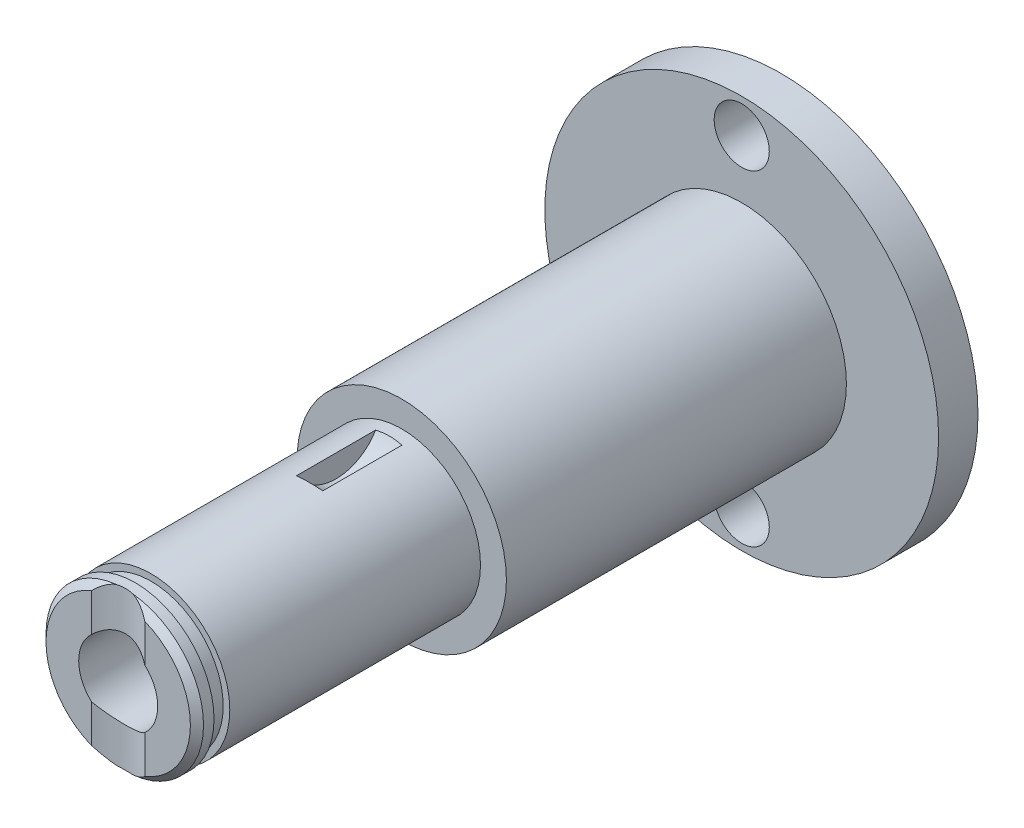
ISO-10303-21;
HEADER;
FILE_DESCRIPTION(('STEP AP214'),'2;1');
FILE_NAME('part.step','',(''),(''),'','','');
FILE_SCHEMA(('AUTOMOTIVE_DESIGN { 1 0 10303 214 1 1 1 1 }'));
ENDSEC;
DATA;
#1=APPLICATION_CONTEXT('core data for automotive mechanical design processes');
#2=APPLICATION_PROTOCOL_DEFINITION('international standard','automotive_design',2000,#1);
#3=PRODUCT_CONTEXT('',#1,'mechanical');
#4=PRODUCT('Part','Part','',(#3));
#5=PRODUCT_RELATED_PRODUCT_CATEGORY('part','',(#4));
#6=PRODUCT_DEFINITION_FORMATION('','',#4);
#7=PRODUCT_DEFINITION_CONTEXT('part definition',#1,'design');
#8=PRODUCT_DEFINITION('design','',#6,#7);
#9=PRODUCT_DEFINITION_SHAPE('','',#8);
#10=(LENGTH_UNIT() NAMED_UNIT(*) SI_UNIT(.MILLI.,.METRE.));
#11=(NAMED_UNIT(*) PLANE_ANGLE_UNIT() SI_UNIT($,.RADIAN.));
#12=(NAMED_UNIT(*) SI_UNIT($,.STERADIAN.) SOLID_ANGLE_UNIT());
#13=UNCERTAINTY_MEASURE_WITH_UNIT(LENGTH_MEASURE(1.E-05),#10,'distance_accuracy_value','');
#14=(GEOMETRIC_REPRESENTATION_CONTEXT(3) GLOBAL_UNCERTAINTY_ASSIGNED_CONTEXT((#13)) GLOBAL_UNIT_ASSIGNED_CONTEXT((#10,
#11,#12)) REPRESENTATION_CONTEXT('',''));
#15=CARTESIAN_POINT('',(0.,0.,0.));
#16=DIRECTION('',(0.,0.,1.));
#17=DIRECTION('',(1.,0.,0.));
#18=AXIS2_PLACEMENT_3D('',#15,#16,#17);
#19=CARTESIAN_POINT('',(-2.22044604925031E-13,-2.22044604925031E-13,47.5));
#20=DIRECTION('',(0.,0.,-1.));
#21=DIRECTION('',(-1.,0.,0.));
#22=AXIS2_PLACEMENT_3D('',#19,#20,#21);
#23=CYLINDRICAL_SURFACE('',#22,6.);
#24=CARTESIAN_POINT('',(-2.22044604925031E-13,0.,25.9));
#25=DIRECTION('',(0.,0.,1.));
#26=DIRECTION('',(1.,0.,0.));
#27=AXIS2_PLACEMENT_3D('',#24,#25,#26);
#28=CIRCLE('',#27,6.);
#29=CARTESIAN_POINT('',(5.99999999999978,0.,25.9));
#30=VERTEX_POINT('',#29);
#31=EDGE_CURVE('E133',#30,#30,#28,.T.);
#32=ORIENTED_EDGE('',*,*,#31,.T.);
#33=EDGE_LOOP('',(#32));
#34=FACE_BOUND('',#33,.T.);
#35=DIRECTION('',(0.,0.,-1.));
#36=VECTOR('',#35,1.);
#37=CARTESIAN_POINT('',(-1.00000000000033,5.91607978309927,47.5));
#38=LINE('',#37,#36);
#39=CARTESIAN_POINT('',(-1.00000000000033,5.91607978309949,26.8887496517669));
#40=VERTEX_POINT('',#39);
#41=CARTESIAN_POINT('',(-1.00000000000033,5.91607978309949,32.9112503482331));
#42=VERTEX_POINT('',#41);
#43=EDGE_CURVE('E111',#40,#42,#38,.F.);
#44=ORIENTED_EDGE('',*,*,#43,.F.);
#45=CARTESIAN_POINT('',(-1.00000000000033,5.91607978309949,26.8887496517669));
#46=CARTESIAN_POINT('',(-0.926439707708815,5.9285143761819,26.8813874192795));
#47=CARTESIAN_POINT('',(-0.852571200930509,5.93958829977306,26.874926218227));
#48=CARTESIAN_POINT('',(-0.704345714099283,5.95898345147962,26.8637207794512));
#49=CARTESIAN_POINT('',(-0.629988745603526,5.96730474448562,26.8589765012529));
#50=CARTESIAN_POINT('',(-0.406292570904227,5.98810079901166,26.8471867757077));
#51=CARTESIAN_POINT('',(-0.256406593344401,5.99639444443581,26.8425920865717));
#52=CARTESIAN_POINT('',(0.0411461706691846,6.00167491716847,26.8396576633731));
#53=CARTESIAN_POINT('',(0.188809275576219,5.99884397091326,26.8412171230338));
#54=CARTESIAN_POINT('',(0.483253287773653,5.98232174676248,26.8504629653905));
#55=CARTESIAN_POINT('',(0.630034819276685,5.96863937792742,26.8581443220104));
#56=CARTESIAN_POINT('',(0.81328199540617,5.9447458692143,26.8719459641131));
#57=CARTESIAN_POINT('',(0.850680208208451,5.93950918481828,26.8749854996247));
#58=CARTESIAN_POINT('',(0.925411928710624,5.9283253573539,26.8815215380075));
#59=CARTESIAN_POINT('',(0.962745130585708,5.92237672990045,26.8850189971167));
#60=CARTESIAN_POINT('',(0.99999999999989,5.91607978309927,26.8887496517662));
#61=B_SPLINE_CURVE_WITH_KNOTS('',3,(#45,#46,#47,#48,#49,#50,#51,#52,#53,#54,#55,#56,#57,#58,#59,
#60),.UNSPECIFIED.,.F.,.F.,(4,2,2,2,2,2,2,4),(0.,0.224857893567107,0.449710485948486,
0.89965480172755,1.34225977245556,1.78450173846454,1.89815161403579,2.01204271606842),.UNSPECIFIED.);
#62=CARTESIAN_POINT('',(0.99999999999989,5.91607978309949,26.8887496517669));
#63=VERTEX_POINT('',#62);
#64=EDGE_CURVE('E165',#40,#63,#61,.T.);
#65=ORIENTED_EDGE('',*,*,#64,.T.);
#66=DIRECTION('',(0.,0.,-1.));
#67=VECTOR('',#66,1.);
#68=CARTESIAN_POINT('',(0.99999999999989,5.91607978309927,47.5));
#69=LINE('',#68,#67);
#70=CARTESIAN_POINT('',(0.99999999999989,5.91607978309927,32.9112503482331));
#71=VERTEX_POINT('',#70);
#72=EDGE_CURVE('E154',#63,#71,#69,.F.);
#73=ORIENTED_EDGE('',*,*,#72,.T.);
#74=CARTESIAN_POINT('',(0.99999999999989,5.91607978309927,32.9112503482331));
#75=CARTESIAN_POINT('',(0.926439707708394,5.92851437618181,32.9186125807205));
#76=CARTESIAN_POINT('',(0.852571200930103,5.93958829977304,32.925073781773));
#77=CARTESIAN_POINT('',(0.704345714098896,5.95898345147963,32.9362792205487));
#78=CARTESIAN_POINT('',(0.629988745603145,5.96730474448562,32.941023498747));
#79=CARTESIAN_POINT('',(0.40629257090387,5.98810079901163,32.9528132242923));
#80=CARTESIAN_POINT('',(0.256406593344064,5.9963944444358,32.9574079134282));
#81=CARTESIAN_POINT('',(-0.0411461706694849,6.00167491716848,32.9603423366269));
#82=CARTESIAN_POINT('',(-0.188809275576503,5.99884397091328,32.9587828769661));
#83=CARTESIAN_POINT('',(-0.483253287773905,5.98232174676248,32.9495370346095));
#84=CARTESIAN_POINT('',(-0.630034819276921,5.96863937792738,32.9418556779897));
#85=CARTESIAN_POINT('',(-0.813281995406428,5.94474586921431,32.9280540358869));
#86=CARTESIAN_POINT('',(-0.850680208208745,5.93950918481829,32.9250145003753));
#87=CARTESIAN_POINT('',(-0.925411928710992,5.92832535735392,32.9184784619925));
#88=CARTESIAN_POINT('',(-0.962745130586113,5.92237672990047,32.9149810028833));
#89=CARTESIAN_POINT('',(-1.00000000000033,5.91607978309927,32.9112503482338));
#90=B_SPLINE_CURVE_WITH_KNOTS('',3,(#74,#75,#76,#77,#78,#79,#80,#81,#82,#83,#84,#85,#86,#87,#88,
#89),.UNSPECIFIED.,.F.,.F.,(4,2,2,2,2,2,2,4),(0.,0.224857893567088,0.449710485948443,
0.899654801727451,1.34225977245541,1.78450173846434,1.8981516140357,2.01204271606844),.UNSPECIFIED.);
#91=EDGE_CURVE('E157',#71,#42,#90,.T.);
#92=ORIENTED_EDGE('',*,*,#91,.T.);
#93=EDGE_LOOP('',(#44,#65,#73,#92));
#94=FACE_BOUND('',#93,.T.);
#95=CARTESIAN_POINT('',(-2.22044604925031E-13,0.,45.));
#96=DIRECTION('',(0.,0.,1.));
#97=DIRECTION('',(1.,0.,0.));
#98=AXIS2_PLACEMENT_3D('',#95,#96,#97);
#99=CIRCLE('',#98,6.);
#100=CARTESIAN_POINT('',(5.99999999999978,0.,45.));
#101=VERTEX_POINT('',#100);
#102=EDGE_CURVE('E286',#101,#101,#99,.T.);
#103=ORIENTED_EDGE('',*,*,#102,.F.);
#104=EDGE_LOOP('',(#103));
#105=FACE_BOUND('',#104,.T.);
#106=ADVANCED_FACE('F37',(#34,#94,#105),#23,.T.);
#107=CARTESIAN_POINT('',(-2.22044604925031E-13,-2.22044604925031E-13,47.5));
#108=DIRECTION('',(0.,0.,1.));
#109=DIRECTION('',(1.,0.,0.));
#110=AXIS2_PLACEMENT_3D('',#107,#108,#109);
#111=PLANE('',#110);
#112=DIRECTION('',(0.,1.,0.));
#113=VECTOR('',#112,1.);
#114=CARTESIAN_POINT('',(2.02422824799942,-15.0000000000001,47.5));
#115=LINE('',#114,#113);
#116=CARTESIAN_POINT('',(2.02422824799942,-5.11395150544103,47.5));
#117=VERTEX_POINT('',#116);
#118=CARTESIAN_POINT('',(2.02422824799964,-2.2276893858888,47.5));
#119=VERTEX_POINT('',#118);
#120=EDGE_CURVE('E57',#117,#119,#115,.T.);
#121=ORIENTED_EDGE('',*,*,#120,.F.);
#122=CARTESIAN_POINT('',(-2.22044604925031E-13,-2.22044604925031E-13,47.5));
#123=DIRECTION('',(0.,0.,1.));
#124=DIRECTION('',(1.,0.,0.));
#125=AXIS2_PLACEMENT_3D('',#122,#123,#124);
#126=CIRCLE('',#125,5.49999999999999);
#127=CARTESIAN_POINT('',(2.02422824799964,5.11395150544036,47.5));
#128=VERTEX_POINT('',#127);
#129=EDGE_CURVE('E118',#117,#128,#126,.T.);
#130=ORIENTED_EDGE('',*,*,#129,.T.);
#131=CARTESIAN_POINT('',(2.02422824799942,2.22768938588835,47.5));
#132=VERTEX_POINT('',#131);
#133=EDGE_CURVE('E105',#132,#128,#115,.T.);
#134=ORIENTED_EDGE('',*,*,#133,.F.);
#135=CARTESIAN_POINT('',(-2.22044604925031E-13,-2.22044604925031E-13,47.5));
#136=DIRECTION('',(0.,0.,1.));
#137=DIRECTION('',(1.,0.,0.));
#138=AXIS2_PLACEMENT_3D('',#135,#136,#137);
#139=CIRCLE('',#138,3.01);
#140=EDGE_CURVE('E116',#119,#132,#139,.T.);
#141=ORIENTED_EDGE('',*,*,#140,.F.);
#142=EDGE_LOOP('',(#121,#130,#134,#141));
#143=FACE_BOUND('',#142,.T.);
#144=ADVANCED_FACE('F115',(#143),#111,.T.);
#145=CARTESIAN_POINT('',(-2.22044604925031E-13,-2.22044604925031E-13,47.5));
#146=DIRECTION('',(0.,0.,-1.));
#147=DIRECTION('',(-1.,0.,0.));
#148=AXIS2_PLACEMENT_3D('',#145,#146,#147);
#149=CONICAL_SURFACE('',#148,5.49999999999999,0.785398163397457);
#150=CARTESIAN_POINT('',(2.10745343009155,5.0258292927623,47.5502000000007));
#151=CARTESIAN_POINT('',(2.05073438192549,5.08771138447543,47.5150556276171));
#152=CARTESIAN_POINT('',(1.99194604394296,5.14803737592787,47.4805655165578));
#153=CARTESIAN_POINT('',(1.86980205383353,5.26516004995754,47.4132299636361));
#154=CARTESIAN_POINT('',(1.80643698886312,5.32194898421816,47.3803881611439));
#155=CARTESIAN_POINT('',(1.60774208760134,5.48721217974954,47.2843558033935));
#156=CARTESIAN_POINT('',(1.4650619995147,5.58917810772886,47.2244604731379));
#157=CARTESIAN_POINT('',(1.19999983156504,5.74495211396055,47.1323818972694));
#158=CARTESIAN_POINT('',(1.08203414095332,5.80438386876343,47.0970455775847));
#159=CARTESIAN_POINT('',(0.836833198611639,5.90590625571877,47.0364913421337));
#160=CARTESIAN_POINT('',(0.709639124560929,5.94806894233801,47.0112313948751));
#161=CARTESIAN_POINT('',(0.446843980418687,6.01211638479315,46.9728006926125));
#162=CARTESIAN_POINT('',(0.311166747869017,6.03377646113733,46.9597639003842));
#163=CARTESIAN_POINT('',(0.0374009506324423,6.05360138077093,46.94783342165));
#164=CARTESIAN_POINT('',(-0.100687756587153,6.05176483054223,46.9489405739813));
#165=CARTESIAN_POINT('',(-0.354562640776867,6.02673089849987,46.9640017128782));
#166=CARTESIAN_POINT('',(-0.470775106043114,6.00654595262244,46.9761439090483));
#167=CARTESIAN_POINT('',(-0.697928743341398,5.95064768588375,47.0096832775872));
#168=CARTESIAN_POINT('',(-0.808868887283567,5.91493135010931,47.0310822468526));
#169=CARTESIAN_POINT('',(-1.06236332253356,5.8149984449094,47.0907391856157));
#170=CARTESIAN_POINT('',(-1.20192878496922,5.74515108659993,47.1322928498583));
#171=CARTESIAN_POINT('',(-1.40004434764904,5.62654283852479,47.2023560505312));
#172=CARTESIAN_POINT('',(-1.46431642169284,5.58461240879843,47.2270507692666));
#173=CARTESIAN_POINT('',(-1.58918094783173,5.49671578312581,47.2786166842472));
#174=CARTESIAN_POINT('',(-1.64977225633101,5.45074834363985,47.3054885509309));
#175=CARTESIAN_POINT('',(-1.78036558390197,5.34475620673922,47.3671766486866));
#176=CARTESIAN_POINT('',(-1.84946298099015,5.28387902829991,47.4024304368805));
#177=CARTESIAN_POINT('',(-1.98234850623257,5.15786137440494,47.4749474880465));
#178=CARTESIAN_POINT('',(-2.04614323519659,5.09272638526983,47.512208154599));
#179=CARTESIAN_POINT('',(-2.10745343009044,5.02582929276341,47.5502));
#180=B_SPLINE_CURVE_WITH_KNOTS('',3,(#150,#151,#152,#153,#154,#155,#156,#157,#158,#159,#160,
#161,#162,#163,#164,#165,#166,#167,#168,#169,#170,#171,#172,#173,#174,#175,#176,#177,#178,#179),
.UNSPECIFIED.,.F.,.F.,(4,2,2,2,2,2,2,2,2,2,2,2,2,2,4),(0.,0.272904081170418,0.546386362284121,
1.09943379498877,1.50819037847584,1.91522362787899,2.32666743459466,2.73813564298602,
3.0922631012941,3.44645933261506,3.92810805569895,4.16980536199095,4.41157738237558,
4.70712792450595,5.0023048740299),.UNSPECIFIED.);
#181=CARTESIAN_POINT('',(0.63047601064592,5.96678305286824,47.));
#182=VERTEX_POINT('',#181);
#183=EDGE_CURVE('E267',#128,#182,#180,.T.);
#184=ORIENTED_EDGE('',*,*,#183,.F.);
#185=ORIENTED_EDGE('',*,*,#129,.F.);
#186=CARTESIAN_POINT('',(-2.10745343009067,-5.02582929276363,47.5502));
#187=CARTESIAN_POINT('',(-2.05073438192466,-5.08771138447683,47.5150556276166));
#188=CARTESIAN_POINT('',(-1.99194604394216,-5.14803737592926,47.4805655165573));
#189=CARTESIAN_POINT('',(-1.86980205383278,-5.26516004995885,47.4132299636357));
#190=CARTESIAN_POINT('',(-1.80643698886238,-5.3219489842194,47.3803881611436));
#191=CARTESIAN_POINT('',(-1.60774208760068,-5.4872121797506,47.2843558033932));
#192=CARTESIAN_POINT('',(-1.46506199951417,-5.58917810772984,47.2244604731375));
#193=CARTESIAN_POINT('',(-1.19999983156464,-5.74495211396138,47.1323818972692));
#194=CARTESIAN_POINT('',(-1.08203414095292,-5.80438386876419,47.0970455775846));
#195=CARTESIAN_POINT('',(-0.836833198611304,-5.90590625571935,47.0364913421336));
#196=CARTESIAN_POINT('',(-0.709639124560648,-5.94806894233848,47.011231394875));
#197=CARTESIAN_POINT('',(-0.446843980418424,-6.0121163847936,46.9728006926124));
#198=CARTESIAN_POINT('',(-0.311166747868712,-6.03377646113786,46.9597639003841));
#199=CARTESIAN_POINT('',(-0.037400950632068,-6.05360138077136,46.94783342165));
#200=CARTESIAN_POINT('',(0.100687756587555,-6.05176483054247,46.9489405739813));
#201=CARTESIAN_POINT('',(0.354562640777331,-6.02673089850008,46.9640017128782));
#202=CARTESIAN_POINT('',(0.470775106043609,-6.00654595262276,46.9761439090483));
#203=CARTESIAN_POINT('',(0.697928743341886,-5.95064768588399,47.0096832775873));
#204=CARTESIAN_POINT('',(0.808868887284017,-5.91493135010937,47.0310822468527));
#205=CARTESIAN_POINT('',(1.06236332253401,-5.81499844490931,47.0907391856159));
#206=CARTESIAN_POINT('',(1.20192878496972,-5.74515108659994,47.1322928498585));
#207=CARTESIAN_POINT('',(1.4000443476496,-5.6265428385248,47.2023560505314));
#208=CARTESIAN_POINT('',(1.46431642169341,-5.58461240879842,47.2270507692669));
#209=CARTESIAN_POINT('',(1.58918094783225,-5.49671578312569,47.2786166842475));
#210=CARTESIAN_POINT('',(1.64977225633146,-5.45074834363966,47.3054885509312));
#211=CARTESIAN_POINT('',(1.78036558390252,-5.34475620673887,47.367176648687));
#212=CARTESIAN_POINT('',(1.84946298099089,-5.28387902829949,47.4024304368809));
#213=CARTESIAN_POINT('',(1.98234850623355,-5.15786137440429,47.474947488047));
#214=CARTESIAN_POINT('',(2.04614323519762,-5.09272638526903,47.5122081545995));
#215=CARTESIAN_POINT('',(2.10745343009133,-5.0258292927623,47.5502000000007));
#216=B_SPLINE_CURVE_WITH_KNOTS('',3,(#186,#187,#188,#189,#190,#191,#192,#193,#194,#195,#196,
#197,#198,#199,#200,#201,#202,#203,#204,#205,#206,#207,#208,#209,#210,#211,#212,#213,#214,#215),
.UNSPECIFIED.,.F.,.F.,(4,2,2,2,2,2,2,2,2,2,2,2,2,2,4),(0.,0.272904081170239,0.546386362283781,
1.09943379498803,1.50819037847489,1.91522362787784,2.32666743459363,2.73813564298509,
3.09226310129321,3.44645933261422,3.92810805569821,4.16980536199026,4.41157738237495,
4.70712792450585,5.00230487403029),.UNSPECIFIED.);
#217=CARTESIAN_POINT('',(0.630476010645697,-5.96678305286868,47.));
#218=VERTEX_POINT('',#217);
#219=EDGE_CURVE('E216',#218,#117,#216,.T.);
#220=ORIENTED_EDGE('',*,*,#219,.F.);
#221=CARTESIAN_POINT('',(-2.22044604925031E-13,-2.22044604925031E-13,47.));
#222=DIRECTION('',(0.,0.,1.));
#223=DIRECTION('',(1.,0.,0.));
#224=AXIS2_PLACEMENT_3D('',#221,#222,#223);
#225=CIRCLE('',#224,6.);
#226=EDGE_CURVE('E150',#182,#218,#225,.F.);
#227=ORIENTED_EDGE('',*,*,#226,.F.);
#228=EDGE_LOOP('',(#184,#185,#220,#227));
#229=FACE_BOUND('',#228,.T.);
#230=ADVANCED_FACE('F229',(#229),#149,.T.);
#231=CARTESIAN_POINT('',(-2.22044604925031E-13,-2.22044604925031E-13,46.2));
#232=DIRECTION('',(0.,0.,1.));
#233=DIRECTION('',(1.,0.,0.));
#234=AXIS2_PLACEMENT_3D('',#231,#232,#233);
#235=CIRCLE('',#234,6.);
#236=CARTESIAN_POINT('',(5.99999999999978,-2.22044604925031E-13,46.2));
#237=VERTEX_POINT('',#236);
#238=EDGE_CURVE('E257',#237,#237,#235,.T.);
#239=ORIENTED_EDGE('',*,*,#238,.T.);
#240=EDGE_LOOP('',(#239));
#241=FACE_BOUND('',#240,.T.);
#242=CARTESIAN_POINT('',(-0.630476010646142,-5.96678305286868,47.));
#243=VERTEX_POINT('',#242);
#244=CARTESIAN_POINT('',(-0.630476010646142,5.96678305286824,47.));
#245=VERTEX_POINT('',#244);
#246=EDGE_CURVE('E153',#243,#245,#225,.F.);
#247=ORIENTED_EDGE('',*,*,#246,.T.);
#248=CARTESIAN_POINT('',(-0.630476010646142,5.96678305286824,47.));
#249=CARTESIAN_POINT('',(-0.526194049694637,5.97782790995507,46.9833305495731));
#250=CARTESIAN_POINT('',(-0.420956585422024,5.98615724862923,46.9707929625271));
#251=CARTESIAN_POINT('',(-0.210473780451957,5.99721865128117,46.9541648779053));
#252=CARTESIAN_POINT('',(-0.105236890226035,5.99999999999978,46.95));
#253=CARTESIAN_POINT('',(0.105236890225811,5.99999999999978,46.95));
#254=CARTESIAN_POINT('',(0.210473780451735,5.99721865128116,46.9541648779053));
#255=CARTESIAN_POINT('',(0.420956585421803,5.98615724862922,46.9707929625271));
#256=CARTESIAN_POINT('',(0.526194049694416,5.97782790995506,46.9833305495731));
#257=CARTESIAN_POINT('',(0.63047601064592,5.96678305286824,47.));
#258=B_SPLINE_CURVE_WITH_KNOTS('',3,(#248,#249,#250,#251,#252,#253,#254,#255,#256,#257),
.UNSPECIFIED.,.F.,.F.,(4,2,2,2,4),(0.,0.318439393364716,0.634037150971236,0.949634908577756,
1.26807430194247),.UNSPECIFIED.);
#259=EDGE_CURVE('E211',#245,#182,#258,.T.);
#260=ORIENTED_EDGE('',*,*,#259,.T.);
#261=ORIENTED_EDGE('',*,*,#226,.T.);
#262=CARTESIAN_POINT('',(0.630476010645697,-5.96678305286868,47.));
#263=CARTESIAN_POINT('',(0.526194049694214,-5.97782790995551,46.9833305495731));
#264=CARTESIAN_POINT('',(0.420956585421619,-5.98615724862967,46.9707929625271));
#265=CARTESIAN_POINT('',(0.210473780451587,-5.99721865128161,46.9541648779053));
#266=CARTESIAN_POINT('',(0.105236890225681,-6.00000000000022,46.95));
#267=CARTESIAN_POINT('',(-0.105236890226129,-6.00000000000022,46.95));
#268=CARTESIAN_POINT('',(-0.210473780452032,-5.99721865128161,46.9541648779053));
#269=CARTESIAN_POINT('',(-0.420956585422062,-5.98615724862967,46.9707929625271));
#270=CARTESIAN_POINT('',(-0.526194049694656,-5.97782790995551,46.9833305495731));
#271=CARTESIAN_POINT('',(-0.630476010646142,-5.96678305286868,47.));
#272=B_SPLINE_CURVE_WITH_KNOTS('',3,(#262,#263,#264,#265,#266,#267,#268,#269,#270,#271),
.UNSPECIFIED.,.F.,.F.,(4,2,2,2,4),(0.,0.318439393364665,0.634037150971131,0.949634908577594,
1.26807430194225),.UNSPECIFIED.);
#273=EDGE_CURVE('E221',#218,#243,#272,.T.);
#274=ORIENTED_EDGE('',*,*,#273,.T.);
#275=EDGE_LOOP('',(#247,#260,#261,#274));
#276=FACE_BOUND('',#275,.T.);
#277=ADVANCED_FACE('F170',(#241,#276),#23,.T.);
#278=CARTESIAN_POINT('',(-2.22044604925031E-13,0.,33.9));
#279=DIRECTION('',(0.,0.,-1.));
#280=DIRECTION('',(-1.,0.,0.));
#281=AXIS2_PLACEMENT_3D('',#278,#279,#280);
#282=CYLINDRICAL_SURFACE('',#281,7.975);
#283=CARTESIAN_POINT('',(0.,0.,0.));
#284=DIRECTION('',(0.,0.,1.));
#285=DIRECTION('',(1.,0.,0.));
#286=AXIS2_PLACEMENT_3D('',#283,#284,#285);
#287=CIRCLE('',#286,7.975);
#288=CARTESIAN_POINT('',(7.975,0.,0.));
#289=VERTEX_POINT('',#288);
#290=EDGE_CURVE('E139',#289,#289,#287,.T.);
#291=ORIENTED_EDGE('',*,*,#290,.T.);
#292=EDGE_LOOP('',(#291));
#293=FACE_BOUND('',#292,.T.);
#294=CARTESIAN_POINT('',(-2.22044604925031E-13,0.,25.9));
#295=DIRECTION('',(0.,0.,1.));
#296=DIRECTION('',(1.,0.,0.));
#297=AXIS2_PLACEMENT_3D('',#294,#295,#296);
#298=CIRCLE('',#297,7.975);
#299=CARTESIAN_POINT('',(7.97499999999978,0.,25.9));
#300=VERTEX_POINT('',#299);
#301=EDGE_CURVE('E136',#300,#300,#298,.T.);
#302=ORIENTED_EDGE('',*,*,#301,.F.);
#303=EDGE_LOOP('',(#302));
#304=FACE_BOUND('',#303,.T.);
#305=ADVANCED_FACE('F245',(#293,#304),#282,.T.);
#306=CARTESIAN_POINT('',(0.,0.,0.));
#307=DIRECTION('',(0.,0.,1.));
#308=DIRECTION('',(1.,0.,0.));
#309=AXIS2_PLACEMENT_3D('',#306,#307,#308);
#310=PLANE('',#309);
#311=CARTESIAN_POINT('',(-2.22044604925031E-13,12.4,0.));
#312=DIRECTION('',(0.,0.,1.));
#313=DIRECTION('',(1.,0.,0.));
#314=AXIS2_PLACEMENT_3D('',#311,#312,#313);
#315=CIRCLE('',#314,2.1);
#316=CARTESIAN_POINT('',(2.09999999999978,12.4,0.));
#317=VERTEX_POINT('',#316);
#318=EDGE_CURVE('E278',#317,#317,#315,.T.);
#319=ORIENTED_EDGE('',*,*,#318,.F.);
#320=EDGE_LOOP('',(#319));
#321=FACE_BOUND('',#320,.T.);
#322=CARTESIAN_POINT('',(-2.22044604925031E-13,-12.4000000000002,0.));
#323=DIRECTION('',(0.,0.,1.));
#324=DIRECTION('',(1.,0.,0.));
#325=AXIS2_PLACEMENT_3D('',#322,#323,#324);
#326=CIRCLE('',#325,2.1);
#327=CARTESIAN_POINT('',(2.09999999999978,-12.4000000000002,0.));
#328=VERTEX_POINT('',#327);
#329=EDGE_CURVE('E272',#328,#328,#326,.T.);
#330=ORIENTED_EDGE('',*,*,#329,.F.);
#331=EDGE_LOOP('',(#330));
#332=FACE_BOUND('',#331,.T.);
#333=CARTESIAN_POINT('',(0.,0.,0.));
#334=DIRECTION('',(0.,0.,1.));
#335=DIRECTION('',(1.,0.,0.));
#336=AXIS2_PLACEMENT_3D('',#333,#334,#335);
#337=CIRCLE('',#336,15.);
#338=CARTESIAN_POINT('',(15.,0.,0.));
#339=VERTEX_POINT('',#338);
#340=EDGE_CURVE('E142',#339,#339,#337,.T.);
#341=ORIENTED_EDGE('',*,*,#340,.T.);
#342=EDGE_LOOP('',(#341));
#343=FACE_BOUND('',#342,.T.);
#344=ORIENTED_EDGE('',*,*,#290,.F.);
#345=EDGE_LOOP('',(#344));
#346=FACE_BOUND('',#345,.T.);
#347=ADVANCED_FACE('F251',(#321,#332,#343,#346),#310,.T.);
#348=CARTESIAN_POINT('',(0.,0.,-3.));
#349=DIRECTION('',(0.,0.,1.));
#350=DIRECTION('',(1.,0.,0.));
#351=AXIS2_PLACEMENT_3D('',#348,#349,#350);
#352=CYLINDRICAL_SURFACE('',#351,15.);
#353=CARTESIAN_POINT('',(0.,0.,-3.));
#354=DIRECTION('',(0.,0.,1.));
#355=DIRECTION('',(1.,0.,0.));
#356=AXIS2_PLACEMENT_3D('',#353,#354,#355);
#357=CIRCLE('',#356,15.);
#358=CARTESIAN_POINT('',(15.,0.,-3.));
#359=VERTEX_POINT('',#358);
#360=EDGE_CURVE('E145',#359,#359,#357,.T.);
#361=ORIENTED_EDGE('',*,*,#360,.T.);
#362=EDGE_LOOP('',(#361));
#363=FACE_BOUND('',#362,.T.);
#364=ORIENTED_EDGE('',*,*,#340,.F.);
#365=EDGE_LOOP('',(#364));
#366=FACE_BOUND('',#365,.T.);
#367=ADVANCED_FACE('F39',(#363,#366),#352,.T.);
#368=CARTESIAN_POINT('',(0.,0.,-3.));
#369=DIRECTION('',(0.,0.,1.));
#370=DIRECTION('',(1.,0.,0.));
#371=AXIS2_PLACEMENT_3D('',#368,#369,#370);
#372=PLANE('',#371);
#373=CARTESIAN_POINT('',(-2.22044604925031E-13,12.4,-3.));
#374=DIRECTION('',(0.,0.,-1.));
#375=DIRECTION('',(-1.,0.,0.));
#376=AXIS2_PLACEMENT_3D('',#373,#374,#375);
#377=CIRCLE('',#376,2.1);
#378=CARTESIAN_POINT('',(-2.10000000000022,12.4,-3.));
#379=VERTEX_POINT('',#378);
#380=EDGE_CURVE('E283',#379,#379,#377,.T.);
#381=ORIENTED_EDGE('',*,*,#380,.F.);
#382=EDGE_LOOP('',(#381));
#383=FACE_BOUND('',#382,.T.);
#384=CARTESIAN_POINT('',(-2.22044604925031E-13,-12.4000000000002,-3.));
#385=DIRECTION('',(0.,0.,-1.));
#386=DIRECTION('',(-1.,0.,0.));
#387=AXIS2_PLACEMENT_3D('',#384,#385,#386);
#388=CIRCLE('',#387,2.1);
#389=CARTESIAN_POINT('',(-2.10000000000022,-12.4000000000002,-3.));
#390=VERTEX_POINT('',#389);
#391=EDGE_CURVE('E274',#390,#390,#388,.T.);
#392=ORIENTED_EDGE('',*,*,#391,.F.);
#393=EDGE_LOOP('',(#392));
#394=FACE_BOUND('',#393,.T.);
#395=CARTESIAN_POINT('',(0.,0.,-3.));
#396=DIRECTION('',(0.,0.,1.));
#397=DIRECTION('',(1.,0.,0.));
#398=AXIS2_PLACEMENT_3D('',#395,#396,#397);
#399=CIRCLE('',#398,3.01);
#400=CARTESIAN_POINT('',(3.01,0.,-3.));
#401=VERTEX_POINT('',#400);
#402=EDGE_CURVE('E125',#401,#401,#399,.T.);
#403=ORIENTED_EDGE('',*,*,#402,.T.);
#404=EDGE_LOOP('',(#403));
#405=FACE_BOUND('',#404,.T.);
#406=ORIENTED_EDGE('',*,*,#360,.F.);
#407=EDGE_LOOP('',(#406));
#408=FACE_BOUND('',#407,.T.);
#409=ADVANCED_FACE('F236',(#383,#394,#405,#408),#372,.F.);
#410=CARTESIAN_POINT('',(-2.22044604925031E-13,0.,25.9));
#411=DIRECTION('',(0.,0.,1.));
#412=DIRECTION('',(1.,0.,0.));
#413=AXIS2_PLACEMENT_3D('',#410,#411,#412);
#414=PLANE('',#413);
#415=ORIENTED_EDGE('',*,*,#31,.F.);
#416=EDGE_LOOP('',(#415));
#417=FACE_BOUND('',#416,.T.);
#418=ORIENTED_EDGE('',*,*,#301,.T.);
#419=EDGE_LOOP('',(#418));
#420=FACE_BOUND('',#419,.T.);
#421=ADVANCED_FACE('F187',(#417,#420),#414,.T.);
#422=DIRECTION('',(0.,1.,0.));
#423=VECTOR('',#422,1.);
#424=CARTESIAN_POINT('',(-2.02422824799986,-15.0000000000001,47.5));
#425=LINE('',#424,#423);
#426=CARTESIAN_POINT('',(-2.02422824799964,5.11395150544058,47.5));
#427=VERTEX_POINT('',#426);
#428=CARTESIAN_POINT('',(-2.02422824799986,2.22768938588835,47.5));
#429=VERTEX_POINT('',#428);
#430=EDGE_CURVE('E64',#427,#429,#425,.F.);
#431=ORIENTED_EDGE('',*,*,#430,.F.);
#432=CARTESIAN_POINT('',(-2.02422824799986,-5.11395150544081,47.5));
#433=VERTEX_POINT('',#432);
#434=EDGE_CURVE('E149',#427,#433,#126,.T.);
#435=ORIENTED_EDGE('',*,*,#434,.T.);
#436=CARTESIAN_POINT('',(-2.02422824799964,-2.22768938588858,47.5));
#437=VERTEX_POINT('',#436);
#438=EDGE_CURVE('E268',#437,#433,#425,.F.);
#439=ORIENTED_EDGE('',*,*,#438,.F.);
#440=EDGE_CURVE('E122',#429,#437,#139,.T.);
#441=ORIENTED_EDGE('',*,*,#440,.F.);
#442=EDGE_LOOP('',(#431,#435,#439,#441));
#443=FACE_BOUND('',#442,.T.);
#444=ADVANCED_FACE('F227',(#443),#111,.T.);
#445=EDGE_CURVE('E119',#245,#427,#180,.T.);
#446=ORIENTED_EDGE('',*,*,#445,.F.);
#447=ORIENTED_EDGE('',*,*,#246,.F.);
#448=EDGE_CURVE('E220',#433,#243,#216,.T.);
#449=ORIENTED_EDGE('',*,*,#448,.F.);
#450=ORIENTED_EDGE('',*,*,#434,.F.);
#451=EDGE_LOOP('',(#446,#447,#449,#450));
#452=FACE_BOUND('',#451,.T.);
#453=ADVANCED_FACE('F185',(#452),#149,.T.);
#454=CARTESIAN_POINT('',(0.,0.,-3.));
#455=DIRECTION('',(0.,0.,1.));
#456=DIRECTION('',(1.,0.,0.));
#457=AXIS2_PLACEMENT_3D('',#454,#455,#456);
#458=CYLINDRICAL_SURFACE('',#457,3.01);
#459=ORIENTED_EDGE('',*,*,#402,.F.);
#460=EDGE_LOOP('',(#459));
#461=FACE_BOUND('',#460,.T.);
#462=ORIENTED_EDGE('',*,*,#440,.T.);
#463=CARTESIAN_POINT('',(-2.02422824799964,-2.22768938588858,47.5));
#464=CARTESIAN_POINT('',(-1.96756053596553,-2.27916097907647,47.4667564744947));
#465=CARTESIAN_POINT('',(-1.9087761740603,-2.32864611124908,47.4341405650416));
#466=CARTESIAN_POINT('',(-1.78692996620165,-2.4234225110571,47.3706669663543));
#467=CARTESIAN_POINT('',(-1.72386424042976,-2.46870988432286,47.339810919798));
#468=CARTESIAN_POINT('',(-1.52735583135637,-2.59845680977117,47.2502803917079));
#469=CARTESIAN_POINT('',(-1.38745891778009,-2.67601399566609,47.1951627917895));
#470=CARTESIAN_POINT('',(-1.16637391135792,-2.77602278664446,47.1230329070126));
#471=CARTESIAN_POINT('',(-1.09051073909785,-2.80671891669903,47.1006859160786));
#472=CARTESIAN_POINT('',(-0.935564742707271,-2.86209208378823,47.0601269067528));
#473=CARTESIAN_POINT('',(-0.856483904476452,-2.88677276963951,47.0419123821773));
#474=CARTESIAN_POINT('',(-0.695971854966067,-2.92960764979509,47.0101655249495));
#475=CARTESIAN_POINT('',(-0.614550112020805,-2.94778498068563,46.9966166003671));
#476=CARTESIAN_POINT('',(-0.44982304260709,-2.97737407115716,46.9745051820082));
#477=CARTESIAN_POINT('',(-0.366518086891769,-2.98878715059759,46.9659417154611));
#478=CARTESIAN_POINT('',(-0.210009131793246,-3.00355298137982,46.9548515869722));
#479=CARTESIAN_POINT('',(-0.136931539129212,-3.00777430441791,46.9516746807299));
#480=CARTESIAN_POINT('',(0.0094285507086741,-3.01087529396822,46.9493414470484));
#481=CARTESIAN_POINT('',(0.082711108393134,-3.00975316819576,46.9501864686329));
#482=CARTESIAN_POINT('',(0.228833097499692,-3.00217998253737,46.9558820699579));
#483=CARTESIAN_POINT('',(0.301672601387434,-2.99572981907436,46.9607319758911));
#484=CARTESIAN_POINT('',(0.446343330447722,-2.97761699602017,46.974315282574));
#485=CARTESIAN_POINT('',(0.518174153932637,-2.96595231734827,46.983050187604));
#486=CARTESIAN_POINT('',(0.721268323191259,-2.92539749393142,47.013309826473));
#487=CARTESIAN_POINT('',(0.850688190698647,-2.89031315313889,47.0393793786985));
#488=CARTESIAN_POINT('',(1.10141799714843,-2.80439330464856,47.1024454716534));
#489=CARTESIAN_POINT('',(1.22271556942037,-2.75353441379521,47.139458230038));
#490=CARTESIAN_POINT('',(1.46620609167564,-2.63258144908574,47.2259662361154));
#491=CARTESIAN_POINT('',(1.58742974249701,-2.56113682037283,47.2763031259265));
#492=CARTESIAN_POINT('',(1.75903125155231,-2.44350358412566,47.356978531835));
#493=CARTESIAN_POINT('',(1.81443715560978,-2.40262954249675,47.3846785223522));
#494=CARTESIAN_POINT('',(1.92186488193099,-2.31758730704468,47.441422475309));
#495=CARTESIAN_POINT('',(1.97388898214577,-2.27342137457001,47.4704655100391));
#496=CARTESIAN_POINT('',(2.02422824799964,-2.2276893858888,47.5));
#497=B_SPLINE_CURVE_WITH_KNOTS('',3,(#463,#464,#465,#466,#467,#468,#469,#470,#471,#472,#473,
#474,#475,#476,#477,#478,#479,#480,#481,#482,#483,#484,#485,#486,#487,#488,#489,#490,#491,#492,
#493,#494,#495,#496),.UNSPECIFIED.,.F.,.F.,(4,2,2,2,2,2,2,2,2,2,2,2,2,2,2,2,4),(0.,
0.250240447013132,0.500710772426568,1.00543669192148,1.25964457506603,1.513697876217,
1.76683814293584,2.01992899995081,2.23943759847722,2.45901982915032,2.67856512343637,
2.89819550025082,3.30612175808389,3.71465561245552,4.16124842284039,4.38375972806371,
4.60611956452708),.UNSPECIFIED.);
#498=EDGE_CURVE('E12',#437,#119,#497,.T.);
#499=ORIENTED_EDGE('',*,*,#498,.T.);
#500=ORIENTED_EDGE('',*,*,#140,.T.);
#501=CARTESIAN_POINT('',(2.02422824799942,2.22768938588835,47.5));
#502=CARTESIAN_POINT('',(1.96756053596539,2.27916097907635,47.4667564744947));
#503=CARTESIAN_POINT('',(1.90877617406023,2.32864611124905,47.4341405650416));
#504=CARTESIAN_POINT('',(1.78692996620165,2.42342251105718,47.3706669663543));
#505=CARTESIAN_POINT('',(1.72386424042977,2.46870988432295,47.339810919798));
#506=CARTESIAN_POINT('',(1.5273558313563,2.59845680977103,47.2502803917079));
#507=CARTESIAN_POINT('',(1.38745891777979,2.67601399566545,47.1951627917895));
#508=CARTESIAN_POINT('',(1.16637391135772,2.77602278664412,47.1230329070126));
#509=CARTESIAN_POINT('',(1.09051073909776,2.80671891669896,47.1006859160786));
#510=CARTESIAN_POINT('',(0.935564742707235,2.86209208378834,47.0601269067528));
#511=CARTESIAN_POINT('',(0.856483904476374,2.88677276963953,47.0419123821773));
#512=CARTESIAN_POINT('',(0.695971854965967,2.92960764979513,47.0101655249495));
#513=CARTESIAN_POINT('',(0.614550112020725,2.94778498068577,46.9966166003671));
#514=CARTESIAN_POINT('',(0.449823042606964,2.97737407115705,46.9745051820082));
#515=CARTESIAN_POINT('',(0.366518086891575,2.98878715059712,46.9659417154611));
#516=CARTESIAN_POINT('',(0.210009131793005,3.0035529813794,46.9548515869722));
#517=CARTESIAN_POINT('',(0.136931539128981,3.0077743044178,46.9516746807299));
#518=CARTESIAN_POINT('',(-0.00942855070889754,3.01087529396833,46.9493414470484));
#519=CARTESIAN_POINT('',(-0.0827111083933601,3.00975316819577,46.9501864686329));
#520=CARTESIAN_POINT('',(-0.228833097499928,3.00217998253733,46.9558820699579));
#521=CARTESIAN_POINT('',(-0.301672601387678,2.99572981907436,46.9607319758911));
#522=CARTESIAN_POINT('',(-0.446343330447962,2.9776169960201,46.974315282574));
#523=CARTESIAN_POINT('',(-0.518174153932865,2.9659523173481,46.983050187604));
#524=CARTESIAN_POINT('',(-0.72126832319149,2.9253974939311,47.013309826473));
#525=CARTESIAN_POINT('',(-0.850688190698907,2.8903131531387,47.0393793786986));
#526=CARTESIAN_POINT('',(-1.10141799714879,2.80439330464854,47.1024454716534));
#527=CARTESIAN_POINT('',(-1.22271556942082,2.75353441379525,47.139458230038));
#528=CARTESIAN_POINT('',(-1.46620609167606,2.63258144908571,47.2259662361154));
#529=CARTESIAN_POINT('',(-1.58742974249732,2.56113682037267,47.2763031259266));
#530=CARTESIAN_POINT('',(-1.75903125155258,2.44350358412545,47.3569785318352));
#531=CARTESIAN_POINT('',(-1.81443715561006,2.40262954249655,47.3846785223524));
#532=CARTESIAN_POINT('',(-1.92186488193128,2.31758730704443,47.4414224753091));
#533=CARTESIAN_POINT('',(-1.97388898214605,2.2734213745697,47.4704655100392));
#534=CARTESIAN_POINT('',(-2.02422824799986,2.22768938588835,47.5));
#535=B_SPLINE_CURVE_WITH_KNOTS('',3,(#501,#502,#503,#504,#505,#506,#507,#508,#509,#510,#511,
#512,#513,#514,#515,#516,#517,#518,#519,#520,#521,#522,#523,#524,#525,#526,#527,#528,#529,#530,
#531,#532,#533,#534),.UNSPECIFIED.,.F.,.F.,(4,2,2,2,2,2,2,2,2,2,2,2,2,2,2,2,4),(0.,
0.25024044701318,0.50071077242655,1.00543669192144,1.25964457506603,1.51369787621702,
1.76683814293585,2.01992899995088,2.23943759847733,2.45901982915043,2.6785651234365,
2.89819550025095,3.3061217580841,3.71465561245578,4.16124842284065,4.38375972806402,
4.6061195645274),.UNSPECIFIED.);
#536=EDGE_CURVE('E50',#132,#429,#535,.T.);
#537=ORIENTED_EDGE('',*,*,#536,.T.);
#538=EDGE_LOOP('',(#462,#499,#500,#537));
#539=FACE_BOUND('',#538,.T.);
#540=ADVANCED_FACE('F121',(#461,#539),#458,.F.);
#541=CARTESIAN_POINT('',(-1.00000000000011,7.69999999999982,29.9));
#542=DIRECTION('',(1.,0.,0.));
#543=DIRECTION('',(0.,0.,-1.));
#544=AXIS2_PLACEMENT_3D('',#541,#542,#543);
#545=CYLINDRICAL_SURFACE('',#544,3.5);
#546=CARTESIAN_POINT('',(-1.00000000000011,7.69999999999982,29.9));
#547=DIRECTION('',(1.,0.,0.));
#548=DIRECTION('',(0.,0.,-1.));
#549=AXIS2_PLACEMENT_3D('',#546,#547,#548);
#550=CIRCLE('',#549,3.5);
#551=EDGE_CURVE('E123',#42,#40,#550,.T.);
#552=ORIENTED_EDGE('',*,*,#551,.F.);
#553=ORIENTED_EDGE('',*,*,#91,.F.);
#554=CARTESIAN_POINT('',(0.999999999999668,7.70000000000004,29.9));
#555=DIRECTION('',(1.,0.,0.));
#556=DIRECTION('',(0.,0.,-1.));
#557=AXIS2_PLACEMENT_3D('',#554,#555,#556);
#558=CIRCLE('',#557,3.5);
#559=EDGE_CURVE('E127',#71,#63,#558,.T.);
#560=ORIENTED_EDGE('',*,*,#559,.T.);
#561=ORIENTED_EDGE('',*,*,#64,.F.);
#562=EDGE_LOOP('',(#552,#553,#560,#561));
#563=FACE_BOUND('',#562,.T.);
#564=ADVANCED_FACE('F174',(#563),#545,.F.);
#565=CARTESIAN_POINT('',(-1.00000000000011,7.69999999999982,29.9));
#566=DIRECTION('',(1.,0.,0.));
#567=DIRECTION('',(0.,0.,-1.));
#568=AXIS2_PLACEMENT_3D('',#565,#566,#567);
#569=PLANE('',#568);
#570=ORIENTED_EDGE('',*,*,#43,.T.);
#571=ORIENTED_EDGE('',*,*,#551,.T.);
#572=EDGE_LOOP('',(#570,#571));
#573=FACE_BOUND('',#572,.T.);
#574=ADVANCED_FACE('F178',(#573),#569,.T.);
#575=CARTESIAN_POINT('',(0.999999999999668,7.70000000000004,29.9));
#576=DIRECTION('',(1.,0.,0.));
#577=DIRECTION('',(0.,0.,-1.));
#578=AXIS2_PLACEMENT_3D('',#575,#576,#577);
#579=PLANE('',#578);
#580=ORIENTED_EDGE('',*,*,#559,.F.);
#581=ORIENTED_EDGE('',*,*,#72,.F.);
#582=EDGE_LOOP('',(#580,#581));
#583=FACE_BOUND('',#582,.T.);
#584=ADVANCED_FACE('F199',(#583),#579,.F.);
#585=CARTESIAN_POINT('',(0.,-15.0000000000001,50.95));
#586=DIRECTION('',(0.,1.,0.));
#587=DIRECTION('',(0.,0.,1.));
#588=AXIS2_PLACEMENT_3D('',#585,#586,#587);
#589=CYLINDRICAL_SURFACE('',#588,4.);
#590=ORIENTED_EDGE('',*,*,#445,.T.);
#591=ORIENTED_EDGE('',*,*,#430,.T.);
#592=ORIENTED_EDGE('',*,*,#536,.F.);
#593=ORIENTED_EDGE('',*,*,#133,.T.);
#594=ORIENTED_EDGE('',*,*,#183,.T.);
#595=ORIENTED_EDGE('',*,*,#259,.F.);
#596=EDGE_LOOP('',(#590,#591,#592,#593,#594,#595));
#597=FACE_BOUND('',#596,.T.);
#598=ADVANCED_FACE('F104',(#597),#589,.F.);
#599=ORIENTED_EDGE('',*,*,#219,.T.);
#600=ORIENTED_EDGE('',*,*,#120,.T.);
#601=ORIENTED_EDGE('',*,*,#498,.F.);
#602=ORIENTED_EDGE('',*,*,#438,.T.);
#603=ORIENTED_EDGE('',*,*,#448,.T.);
#604=ORIENTED_EDGE('',*,*,#273,.F.);
#605=EDGE_LOOP('',(#599,#600,#601,#602,#603,#604));
#606=FACE_BOUND('',#605,.T.);
#607=ADVANCED_FACE('F193',(#606),#589,.F.);
#608=CARTESIAN_POINT('',(-2.22044604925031E-13,-12.4000000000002,47.7012798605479));
#609=DIRECTION('',(0.,0.,-1.));
#610=DIRECTION('',(-1.,0.,0.));
#611=AXIS2_PLACEMENT_3D('',#608,#609,#610);
#612=CYLINDRICAL_SURFACE('',#611,2.1);
#613=ORIENTED_EDGE('',*,*,#329,.T.);
#614=EDGE_LOOP('',(#613));
#615=FACE_BOUND('',#614,.T.);
#616=ORIENTED_EDGE('',*,*,#391,.T.);
#617=EDGE_LOOP('',(#616));
#618=FACE_BOUND('',#617,.T.);
#619=ADVANCED_FACE('F197',(#615,#618),#612,.F.);
#620=CARTESIAN_POINT('',(-2.22044604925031E-13,12.4,47.7012798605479));
#621=DIRECTION('',(0.,0.,-1.));
#622=DIRECTION('',(-1.,0.,0.));
#623=AXIS2_PLACEMENT_3D('',#620,#621,#622);
#624=CYLINDRICAL_SURFACE('',#623,2.1);
#625=ORIENTED_EDGE('',*,*,#318,.T.);
#626=EDGE_LOOP('',(#625));
#627=FACE_BOUND('',#626,.T.);
#628=ORIENTED_EDGE('',*,*,#380,.T.);
#629=EDGE_LOOP('',(#628));
#630=FACE_BOUND('',#629,.T.);
#631=ADVANCED_FACE('F311',(#627,#630),#624,.F.);
#632=CARTESIAN_POINT('',(-2.22044604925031E-13,0.,45.));
#633=DIRECTION('',(0.,0.,1.));
#634=DIRECTION('',(1.,0.,0.));
#635=AXIS2_PLACEMENT_3D('',#632,#633,#634);
#636=PLANE('',#635);
#637=CARTESIAN_POINT('',(-2.22044604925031E-13,0.,45.));
#638=DIRECTION('',(0.,0.,1.));
#639=DIRECTION('',(1.,0.,0.));
#640=AXIS2_PLACEMENT_3D('',#637,#638,#639);
#641=CIRCLE('',#640,5.5);
#642=CARTESIAN_POINT('',(5.49999999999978,0.,45.));
#643=VERTEX_POINT('',#642);
#644=EDGE_CURVE('E290',#643,#643,#641,.T.);
#645=ORIENTED_EDGE('',*,*,#644,.F.);
#646=EDGE_LOOP('',(#645));
#647=FACE_BOUND('',#646,.T.);
#648=ORIENTED_EDGE('',*,*,#102,.T.);
#649=EDGE_LOOP('',(#648));
#650=FACE_BOUND('',#649,.T.);
#651=ADVANCED_FACE('F307',(#647,#650),#636,.T.);
#652=CARTESIAN_POINT('',(-2.22044604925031E-13,-2.22044604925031E-13,46.2));
#653=DIRECTION('',(0.,0.,1.));
#654=DIRECTION('',(1.,0.,0.));
#655=AXIS2_PLACEMENT_3D('',#652,#653,#654);
#656=PLANE('',#655);
#657=CARTESIAN_POINT('',(-2.22044604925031E-13,-2.22044604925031E-13,46.2));
#658=DIRECTION('',(0.,0.,1.));
#659=DIRECTION('',(1.,0.,0.));
#660=AXIS2_PLACEMENT_3D('',#657,#658,#659);
#661=CIRCLE('',#660,5.5);
#662=CARTESIAN_POINT('',(5.49999999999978,-2.22044604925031E-13,46.2));
#663=VERTEX_POINT('',#662);
#664=EDGE_CURVE('E293',#663,#663,#661,.T.);
#665=ORIENTED_EDGE('',*,*,#664,.T.);
#666=EDGE_LOOP('',(#665));
#667=FACE_BOUND('',#666,.T.);
#668=ORIENTED_EDGE('',*,*,#238,.F.);
#669=EDGE_LOOP('',(#668));
#670=FACE_BOUND('',#669,.T.);
#671=ADVANCED_FACE('F297',(#667,#670),#656,.F.);
#672=CARTESIAN_POINT('',(-2.22044604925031E-13,0.,45.));
#673=DIRECTION('',(0.,0.,1.));
#674=DIRECTION('',(1.,0.,0.));
#675=AXIS2_PLACEMENT_3D('',#672,#673,#674);
#676=CYLINDRICAL_SURFACE('',#675,5.5);
#677=ORIENTED_EDGE('',*,*,#644,.T.);
#678=EDGE_LOOP('',(#677));
#679=FACE_BOUND('',#678,.T.);
#680=ORIENTED_EDGE('',*,*,#664,.F.);
#681=EDGE_LOOP('',(#680));
#682=FACE_BOUND('',#681,.T.);
#683=ADVANCED_FACE('F300',(#679,#682),#676,.T.);
#684=CLOSED_SHELL('',(#106,#144,#230,#277,#305,#347,#367,#409,#421,#444,#453,#540,#564,#574,
#584,#598,#607,#619,#631,#651,#671,#683));
#685=MANIFOLD_SOLID_BREP('B2',#684);
#686=ADVANCED_BREP_SHAPE_REPRESENTATION('',(#18,#685),#14);
#687=SHAPE_DEFINITION_REPRESENTATION(#9,#686);
ENDSEC;
END-ISO-10303-21;
